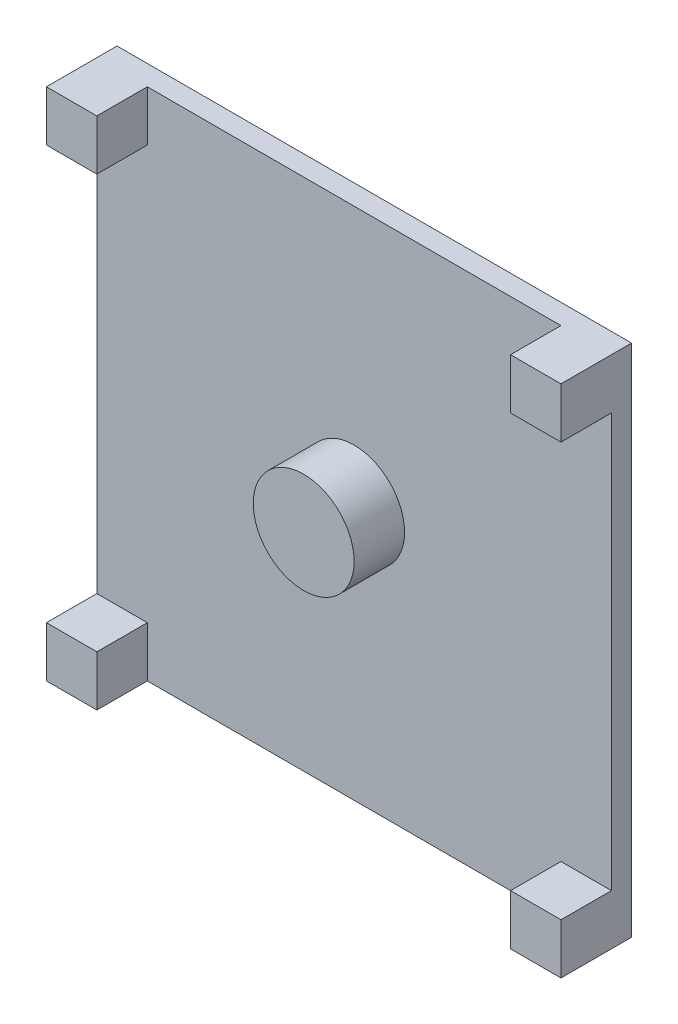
ISO-10303-21;
HEADER;
FILE_DESCRIPTION(('STEP AP214'),'2;1');
FILE_NAME('part.step','',(''),(''),'','','');
FILE_SCHEMA(('AUTOMOTIVE_DESIGN { 1 0 10303 214 1 1 1 1 }'));
ENDSEC;
DATA;
#1=APPLICATION_CONTEXT('core data for automotive mechanical design processes');
#2=APPLICATION_PROTOCOL_DEFINITION('international standard','automotive_design',2000,#1);
#3=PRODUCT_CONTEXT('',#1,'mechanical');
#4=PRODUCT('Part','Part','',(#3));
#5=PRODUCT_RELATED_PRODUCT_CATEGORY('part','',(#4));
#6=PRODUCT_DEFINITION_FORMATION('','',#4);
#7=PRODUCT_DEFINITION_CONTEXT('part definition',#1,'design');
#8=PRODUCT_DEFINITION('design','',#6,#7);
#9=PRODUCT_DEFINITION_SHAPE('','',#8);
#10=(LENGTH_UNIT() NAMED_UNIT(*) SI_UNIT(.MILLI.,.METRE.));
#11=(NAMED_UNIT(*) PLANE_ANGLE_UNIT() SI_UNIT($,.RADIAN.));
#12=(NAMED_UNIT(*) SI_UNIT($,.STERADIAN.) SOLID_ANGLE_UNIT());
#13=UNCERTAINTY_MEASURE_WITH_UNIT(LENGTH_MEASURE(1.E-05),#10,'distance_accuracy_value','');
#14=(GEOMETRIC_REPRESENTATION_CONTEXT(3) GLOBAL_UNCERTAINTY_ASSIGNED_CONTEXT((#13)) GLOBAL_UNIT_ASSIGNED_CONTEXT((#10,
#11,#12)) REPRESENTATION_CONTEXT('',''));
#15=CARTESIAN_POINT('',(0.,0.,0.));
#16=DIRECTION('',(0.,0.,1.));
#17=DIRECTION('',(1.,0.,0.));
#18=AXIS2_PLACEMENT_3D('',#15,#16,#17);
#19=CARTESIAN_POINT('',(-45.621214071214,-476.118135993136,20.));
#20=DIRECTION('',(0.,0.,1.));
#21=DIRECTION('',(1.,0.,0.));
#22=AXIS2_PLACEMENT_3D('',#19,#20,#21);
#23=PLANE('',#22);
#24=DIRECTION('',(0.,-1.,0.));
#25=VECTOR('',#24,1.);
#26=CARTESIAN_POINT('',(414.378785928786,-476.118135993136,20.));
#27=LINE('',#26,#25);
#28=CARTESIAN_POINT('',(414.378785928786,-426.118135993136,20.));
#29=VERTEX_POINT('',#28);
#30=CARTESIAN_POINT('',(414.378785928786,-476.118135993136,20.));
#31=VERTEX_POINT('',#30);
#32=EDGE_CURVE('E48',#29,#31,#27,.T.);
#33=ORIENTED_EDGE('',*,*,#32,.F.);
#34=DIRECTION('',(-1.,0.,0.));
#35=VECTOR('',#34,1.);
#36=CARTESIAN_POINT('',(464.378785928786,-426.118135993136,20.));
#37=LINE('',#36,#35);
#38=CARTESIAN_POINT('',(464.378785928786,-426.118135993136,20.));
#39=VERTEX_POINT('',#38);
#40=EDGE_CURVE('E338',#39,#29,#37,.T.);
#41=ORIENTED_EDGE('',*,*,#40,.F.);
#42=DIRECTION('',(0.,1.,0.));
#43=VECTOR('',#42,1.);
#44=CARTESIAN_POINT('',(464.378785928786,33.881864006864,20.));
#45=LINE('',#44,#43);
#46=CARTESIAN_POINT('',(464.378785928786,-16.118135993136,20.));
#47=VERTEX_POINT('',#46);
#48=EDGE_CURVE('E167',#39,#47,#45,.T.);
#49=ORIENTED_EDGE('',*,*,#48,.T.);
#50=DIRECTION('',(1.,0.,0.));
#51=VECTOR('',#50,1.);
#52=CARTESIAN_POINT('',(464.378785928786,-16.118135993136,20.));
#53=LINE('',#52,#51);
#54=CARTESIAN_POINT('',(414.378785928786,-16.118135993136,20.));
#55=VERTEX_POINT('',#54);
#56=EDGE_CURVE('E202',#55,#47,#53,.T.);
#57=ORIENTED_EDGE('',*,*,#56,.F.);
#58=DIRECTION('',(0.,-1.,0.));
#59=VECTOR('',#58,1.);
#60=CARTESIAN_POINT('',(414.378785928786,33.881864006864,20.));
#61=LINE('',#60,#59);
#62=CARTESIAN_POINT('',(414.378785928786,33.881864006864,20.));
#63=VERTEX_POINT('',#62);
#64=EDGE_CURVE('E197',#63,#55,#61,.T.);
#65=ORIENTED_EDGE('',*,*,#64,.F.);
#66=DIRECTION('',(-1.,0.,0.));
#67=VECTOR('',#66,1.);
#68=CARTESIAN_POINT('',(-45.6212140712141,33.881864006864,20.));
#69=LINE('',#68,#67);
#70=CARTESIAN_POINT('',(4.37878592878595,33.881864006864,20.));
#71=VERTEX_POINT('',#70);
#72=EDGE_CURVE('E34',#63,#71,#69,.T.);
#73=ORIENTED_EDGE('',*,*,#72,.T.);
#74=DIRECTION('',(0.,1.,0.));
#75=VECTOR('',#74,1.);
#76=CARTESIAN_POINT('',(4.37878592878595,33.881864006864,20.));
#77=LINE('',#76,#75);
#78=CARTESIAN_POINT('',(4.37878592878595,-16.118135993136,20.));
#79=VERTEX_POINT('',#78);
#80=EDGE_CURVE('E223',#79,#71,#77,.T.);
#81=ORIENTED_EDGE('',*,*,#80,.F.);
#82=DIRECTION('',(1.,0.,0.));
#83=VECTOR('',#82,1.);
#84=CARTESIAN_POINT('',(-45.6212140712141,-16.118135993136,20.));
#85=LINE('',#84,#83);
#86=CARTESIAN_POINT('',(-45.6212140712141,-16.118135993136,20.));
#87=VERTEX_POINT('',#86);
#88=EDGE_CURVE('E218',#87,#79,#85,.T.);
#89=ORIENTED_EDGE('',*,*,#88,.F.);
#90=DIRECTION('',(0.,-1.,0.));
#91=VECTOR('',#90,1.);
#92=CARTESIAN_POINT('',(-45.6212140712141,33.881864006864,20.));
#93=LINE('',#92,#91);
#94=CARTESIAN_POINT('',(-45.621214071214,-426.118135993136,20.));
#95=VERTEX_POINT('',#94);
#96=EDGE_CURVE('E264',#87,#95,#93,.T.);
#97=ORIENTED_EDGE('',*,*,#96,.T.);
#98=DIRECTION('',(-1.,0.,0.));
#99=VECTOR('',#98,1.);
#100=CARTESIAN_POINT('',(-45.621214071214,-426.118135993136,20.));
#101=LINE('',#100,#99);
#102=CARTESIAN_POINT('',(4.37878592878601,-426.118135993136,20.));
#103=VERTEX_POINT('',#102);
#104=EDGE_CURVE('E171',#103,#95,#101,.T.);
#105=ORIENTED_EDGE('',*,*,#104,.F.);
#106=DIRECTION('',(0.,1.,0.));
#107=VECTOR('',#106,1.);
#108=CARTESIAN_POINT('',(4.37878592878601,-476.118135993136,20.));
#109=LINE('',#108,#107);
#110=CARTESIAN_POINT('',(4.37878592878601,-476.118135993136,20.));
#111=VERTEX_POINT('',#110);
#112=EDGE_CURVE('E168',#111,#103,#109,.T.);
#113=ORIENTED_EDGE('',*,*,#112,.F.);
#114=DIRECTION('',(1.,0.,0.));
#115=VECTOR('',#114,1.);
#116=CARTESIAN_POINT('',(-45.621214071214,-476.118135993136,20.));
#117=LINE('',#116,#115);
#118=EDGE_CURVE('E53',#111,#31,#117,.T.);
#119=ORIENTED_EDGE('',*,*,#118,.T.);
#120=EDGE_LOOP('',(#33,#41,#49,#57,#65,#73,#81,#89,#97,#105,#113,#119));
#121=FACE_BOUND('',#120,.T.);
#122=CARTESIAN_POINT('',(209.378785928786,-221.118135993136,20.));
#123=DIRECTION('',(0.,0.,1.));
#124=DIRECTION('',(1.,0.,0.));
#125=AXIS2_PLACEMENT_3D('',#122,#123,#124);
#126=CIRCLE('',#125,50.0000000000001);
#127=CARTESIAN_POINT('',(259.378785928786,-221.118135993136,20.));
#128=VERTEX_POINT('',#127);
#129=EDGE_CURVE('E342',#128,#128,#126,.T.);
#130=ORIENTED_EDGE('',*,*,#129,.F.);
#131=EDGE_LOOP('',(#130));
#132=FACE_BOUND('',#131,.T.);
#133=ADVANCED_FACE('F30',(#121,#132),#23,.T.);
#134=CARTESIAN_POINT('',(-45.6212140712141,33.881864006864,20.));
#135=DIRECTION('',(1.,0.,0.));
#136=DIRECTION('',(0.,1.,0.));
#137=AXIS2_PLACEMENT_3D('',#134,#135,#136);
#138=PLANE('',#137);
#139=DIRECTION('',(0.,-1.,0.));
#140=VECTOR('',#139,1.);
#141=CARTESIAN_POINT('',(-45.6212140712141,33.881864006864,0.));
#142=LINE('',#141,#140);
#143=CARTESIAN_POINT('',(-45.6212140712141,33.881864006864,0.));
#144=VERTEX_POINT('',#143);
#145=CARTESIAN_POINT('',(-45.621214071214,-476.118135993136,0.));
#146=VERTEX_POINT('',#145);
#147=EDGE_CURVE('E253',#144,#146,#142,.T.);
#148=ORIENTED_EDGE('',*,*,#147,.T.);
#149=DIRECTION('',(0.,0.,-1.));
#150=VECTOR('',#149,1.);
#151=CARTESIAN_POINT('',(-45.621214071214,-476.118135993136,20.));
#152=LINE('',#151,#150);
#153=CARTESIAN_POINT('',(-45.621214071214,-476.118135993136,70.));
#154=VERTEX_POINT('',#153);
#155=EDGE_CURVE('E11',#154,#146,#152,.T.);
#156=ORIENTED_EDGE('',*,*,#155,.F.);
#157=DIRECTION('',(0.,-1.,0.));
#158=VECTOR('',#157,1.);
#159=CARTESIAN_POINT('',(-45.621214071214,-476.118135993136,70.));
#160=LINE('',#159,#158);
#161=CARTESIAN_POINT('',(-45.621214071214,-426.118135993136,70.));
#162=VERTEX_POINT('',#161);
#163=EDGE_CURVE('E177',#162,#154,#160,.T.);
#164=ORIENTED_EDGE('',*,*,#163,.F.);
#165=DIRECTION('',(0.,0.,-1.));
#166=VECTOR('',#165,1.);
#167=CARTESIAN_POINT('',(-45.621214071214,-426.118135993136,70.));
#168=LINE('',#167,#166);
#169=EDGE_CURVE('E185',#162,#95,#168,.T.);
#170=ORIENTED_EDGE('',*,*,#169,.T.);
#171=ORIENTED_EDGE('',*,*,#96,.F.);
#172=DIRECTION('',(0.,0.,-1.));
#173=VECTOR('',#172,1.);
#174=CARTESIAN_POINT('',(-45.6212140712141,-16.118135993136,70.));
#175=LINE('',#174,#173);
#176=CARTESIAN_POINT('',(-45.6212140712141,-16.118135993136,70.));
#177=VERTEX_POINT('',#176);
#178=EDGE_CURVE('E248',#177,#87,#175,.T.);
#179=ORIENTED_EDGE('',*,*,#178,.F.);
#180=DIRECTION('',(0.,-1.,0.));
#181=VECTOR('',#180,1.);
#182=CARTESIAN_POINT('',(-45.6212140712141,33.881864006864,70.));
#183=LINE('',#182,#181);
#184=CARTESIAN_POINT('',(-45.6212140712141,33.881864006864,70.));
#185=VERTEX_POINT('',#184);
#186=EDGE_CURVE('E219',#185,#177,#183,.T.);
#187=ORIENTED_EDGE('',*,*,#186,.F.);
#188=DIRECTION('',(0.,0.,-1.));
#189=VECTOR('',#188,1.);
#190=CARTESIAN_POINT('',(-45.6212140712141,33.881864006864,20.));
#191=LINE('',#190,#189);
#192=EDGE_CURVE('E276',#185,#144,#191,.T.);
#193=ORIENTED_EDGE('',*,*,#192,.T.);
#194=EDGE_LOOP('',(#148,#156,#164,#170,#171,#179,#187,#193));
#195=FACE_BOUND('',#194,.T.);
#196=ADVANCED_FACE('F32',(#195),#138,.F.);
#197=CARTESIAN_POINT('',(-45.621214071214,-476.118135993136,20.));
#198=DIRECTION('',(0.,1.,0.));
#199=DIRECTION('',(0.,0.,1.));
#200=AXIS2_PLACEMENT_3D('',#197,#198,#199);
#201=PLANE('',#200);
#202=DIRECTION('',(1.,0.,0.));
#203=VECTOR('',#202,1.);
#204=CARTESIAN_POINT('',(-45.621214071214,-476.118135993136,0.));
#205=LINE('',#204,#203);
#206=CARTESIAN_POINT('',(464.378785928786,-476.118135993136,0.));
#207=VERTEX_POINT('',#206);
#208=EDGE_CURVE('E258',#146,#207,#205,.T.);
#209=ORIENTED_EDGE('',*,*,#208,.T.);
#210=DIRECTION('',(0.,0.,-1.));
#211=VECTOR('',#210,1.);
#212=CARTESIAN_POINT('',(464.378785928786,-476.118135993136,20.));
#213=LINE('',#212,#211);
#214=CARTESIAN_POINT('',(464.378785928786,-476.118135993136,70.));
#215=VERTEX_POINT('',#214);
#216=EDGE_CURVE('E40',#215,#207,#213,.T.);
#217=ORIENTED_EDGE('',*,*,#216,.F.);
#218=DIRECTION('',(1.,0.,0.));
#219=VECTOR('',#218,1.);
#220=CARTESIAN_POINT('',(464.378785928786,-476.118135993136,70.));
#221=LINE('',#220,#219);
#222=CARTESIAN_POINT('',(414.378785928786,-476.118135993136,70.));
#223=VERTEX_POINT('',#222);
#224=EDGE_CURVE('E161',#223,#215,#221,.T.);
#225=ORIENTED_EDGE('',*,*,#224,.F.);
#226=DIRECTION('',(0.,0.,-1.));
#227=VECTOR('',#226,1.);
#228=CARTESIAN_POINT('',(414.378785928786,-476.118135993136,70.));
#229=LINE('',#228,#227);
#230=EDGE_CURVE('E173',#223,#31,#229,.T.);
#231=ORIENTED_EDGE('',*,*,#230,.T.);
#232=ORIENTED_EDGE('',*,*,#118,.F.);
#233=DIRECTION('',(0.,0.,-1.));
#234=VECTOR('',#233,1.);
#235=CARTESIAN_POINT('',(4.37878592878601,-476.118135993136,70.));
#236=LINE('',#235,#234);
#237=CARTESIAN_POINT('',(4.37878592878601,-476.118135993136,70.));
#238=VERTEX_POINT('',#237);
#239=EDGE_CURVE('E194',#238,#111,#236,.T.);
#240=ORIENTED_EDGE('',*,*,#239,.F.);
#241=DIRECTION('',(1.,0.,0.));
#242=VECTOR('',#241,1.);
#243=CARTESIAN_POINT('',(-45.621214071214,-476.118135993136,70.));
#244=LINE('',#243,#242);
#245=EDGE_CURVE('E180',#154,#238,#244,.T.);
#246=ORIENTED_EDGE('',*,*,#245,.F.);
#247=ORIENTED_EDGE('',*,*,#155,.T.);
#248=EDGE_LOOP('',(#209,#217,#225,#231,#232,#240,#246,#247));
#249=FACE_BOUND('',#248,.T.);
#250=ADVANCED_FACE('F311',(#249),#201,.F.);
#251=CARTESIAN_POINT('',(464.378785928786,33.881864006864,20.));
#252=DIRECTION('',(-1.,0.,0.));
#253=DIRECTION('',(0.,-1.,0.));
#254=AXIS2_PLACEMENT_3D('',#251,#252,#253);
#255=PLANE('',#254);
#256=DIRECTION('',(0.,1.,0.));
#257=VECTOR('',#256,1.);
#258=CARTESIAN_POINT('',(464.378785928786,33.881864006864,0.));
#259=LINE('',#258,#257);
#260=CARTESIAN_POINT('',(464.378785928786,33.881864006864,0.));
#261=VERTEX_POINT('',#260);
#262=EDGE_CURVE('E273',#207,#261,#259,.T.);
#263=ORIENTED_EDGE('',*,*,#262,.T.);
#264=DIRECTION('',(0.,0.,-1.));
#265=VECTOR('',#264,1.);
#266=CARTESIAN_POINT('',(464.378785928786,33.881864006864,20.));
#267=LINE('',#266,#265);
#268=CARTESIAN_POINT('',(464.378785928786,33.881864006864,70.));
#269=VERTEX_POINT('',#268);
#270=EDGE_CURVE('E279',#269,#261,#267,.T.);
#271=ORIENTED_EDGE('',*,*,#270,.F.);
#272=DIRECTION('',(0.,1.,0.));
#273=VECTOR('',#272,1.);
#274=CARTESIAN_POINT('',(464.378785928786,33.881864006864,70.));
#275=LINE('',#274,#273);
#276=CARTESIAN_POINT('',(464.378785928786,-16.118135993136,70.));
#277=VERTEX_POINT('',#276);
#278=EDGE_CURVE('E198',#277,#269,#275,.T.);
#279=ORIENTED_EDGE('',*,*,#278,.F.);
#280=DIRECTION('',(0.,0.,-1.));
#281=VECTOR('',#280,1.);
#282=CARTESIAN_POINT('',(464.378785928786,-16.118135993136,70.));
#283=LINE('',#282,#281);
#284=EDGE_CURVE('E208',#277,#47,#283,.T.);
#285=ORIENTED_EDGE('',*,*,#284,.T.);
#286=ORIENTED_EDGE('',*,*,#48,.F.);
#287=DIRECTION('',(0.,0.,-1.));
#288=VECTOR('',#287,1.);
#289=CARTESIAN_POINT('',(464.378785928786,-426.118135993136,70.));
#290=LINE('',#289,#288);
#291=CARTESIAN_POINT('',(464.378785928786,-426.118135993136,70.));
#292=VERTEX_POINT('',#291);
#293=EDGE_CURVE('E149',#292,#39,#290,.T.);
#294=ORIENTED_EDGE('',*,*,#293,.F.);
#295=DIRECTION('',(0.,1.,0.));
#296=VECTOR('',#295,1.);
#297=CARTESIAN_POINT('',(464.378785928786,-476.118135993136,70.));
#298=LINE('',#297,#296);
#299=EDGE_CURVE('E155',#215,#292,#298,.T.);
#300=ORIENTED_EDGE('',*,*,#299,.F.);
#301=ORIENTED_EDGE('',*,*,#216,.T.);
#302=EDGE_LOOP('',(#263,#271,#279,#285,#286,#294,#300,#301));
#303=FACE_BOUND('',#302,.T.);
#304=ADVANCED_FACE('F165',(#303),#255,.F.);
#305=CARTESIAN_POINT('',(-45.6212140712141,33.881864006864,20.));
#306=DIRECTION('',(0.,-1.,0.));
#307=DIRECTION('',(0.,0.,-1.));
#308=AXIS2_PLACEMENT_3D('',#305,#306,#307);
#309=PLANE('',#308);
#310=DIRECTION('',(-1.,0.,0.));
#311=VECTOR('',#310,1.);
#312=CARTESIAN_POINT('',(-45.6212140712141,33.881864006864,0.));
#313=LINE('',#312,#311);
#314=EDGE_CURVE('E265',#261,#144,#313,.T.);
#315=ORIENTED_EDGE('',*,*,#314,.T.);
#316=ORIENTED_EDGE('',*,*,#192,.F.);
#317=DIRECTION('',(-1.,0.,0.));
#318=VECTOR('',#317,1.);
#319=CARTESIAN_POINT('',(-45.6212140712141,33.881864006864,70.));
#320=LINE('',#319,#318);
#321=CARTESIAN_POINT('',(4.37878592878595,33.881864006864,70.));
#322=VERTEX_POINT('',#321);
#323=EDGE_CURVE('E227',#322,#185,#320,.T.);
#324=ORIENTED_EDGE('',*,*,#323,.F.);
#325=DIRECTION('',(0.,0.,-1.));
#326=VECTOR('',#325,1.);
#327=CARTESIAN_POINT('',(4.37878592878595,33.881864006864,70.));
#328=LINE('',#327,#326);
#329=EDGE_CURVE('E230',#322,#71,#328,.T.);
#330=ORIENTED_EDGE('',*,*,#329,.T.);
#331=ORIENTED_EDGE('',*,*,#72,.F.);
#332=DIRECTION('',(0.,0.,-1.));
#333=VECTOR('',#332,1.);
#334=CARTESIAN_POINT('',(414.378785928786,33.881864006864,70.));
#335=LINE('',#334,#333);
#336=CARTESIAN_POINT('',(414.378785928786,33.881864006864,70.));
#337=VERTEX_POINT('',#336);
#338=EDGE_CURVE('E216',#337,#63,#335,.T.);
#339=ORIENTED_EDGE('',*,*,#338,.F.);
#340=DIRECTION('',(-1.,0.,0.));
#341=VECTOR('',#340,1.);
#342=CARTESIAN_POINT('',(464.378785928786,33.881864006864,70.));
#343=LINE('',#342,#341);
#344=EDGE_CURVE('E201',#269,#337,#343,.T.);
#345=ORIENTED_EDGE('',*,*,#344,.F.);
#346=ORIENTED_EDGE('',*,*,#270,.T.);
#347=EDGE_LOOP('',(#315,#316,#324,#330,#331,#339,#345,#346));
#348=FACE_BOUND('',#347,.T.);
#349=ADVANCED_FACE('F287',(#348),#309,.F.);
#350=CARTESIAN_POINT('',(-45.621214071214,-476.118135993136,0.));
#351=DIRECTION('',(0.,0.,1.));
#352=DIRECTION('',(1.,0.,0.));
#353=AXIS2_PLACEMENT_3D('',#350,#351,#352);
#354=PLANE('',#353);
#355=ORIENTED_EDGE('',*,*,#147,.F.);
#356=ORIENTED_EDGE('',*,*,#314,.F.);
#357=ORIENTED_EDGE('',*,*,#262,.F.);
#358=ORIENTED_EDGE('',*,*,#208,.F.);
#359=EDGE_LOOP('',(#355,#356,#357,#358));
#360=FACE_BOUND('',#359,.T.);
#361=ADVANCED_FACE('F286',(#360),#354,.F.);
#362=CARTESIAN_POINT('',(-45.6212140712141,-16.118135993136,70.));
#363=DIRECTION('',(0.,1.,0.));
#364=DIRECTION('',(0.,0.,1.));
#365=AXIS2_PLACEMENT_3D('',#362,#363,#364);
#366=PLANE('',#365);
#367=ORIENTED_EDGE('',*,*,#88,.T.);
#368=DIRECTION('',(0.,0.,-1.));
#369=VECTOR('',#368,1.);
#370=CARTESIAN_POINT('',(4.37878592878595,-16.118135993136,70.));
#371=LINE('',#370,#369);
#372=CARTESIAN_POINT('',(4.37878592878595,-16.118135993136,70.));
#373=VERTEX_POINT('',#372);
#374=EDGE_CURVE('E233',#373,#79,#371,.T.);
#375=ORIENTED_EDGE('',*,*,#374,.F.);
#376=DIRECTION('',(1.,0.,0.));
#377=VECTOR('',#376,1.);
#378=CARTESIAN_POINT('',(-45.6212140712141,-16.118135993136,70.));
#379=LINE('',#378,#377);
#380=EDGE_CURVE('E222',#177,#373,#379,.T.);
#381=ORIENTED_EDGE('',*,*,#380,.F.);
#382=ORIENTED_EDGE('',*,*,#178,.T.);
#383=EDGE_LOOP('',(#367,#375,#381,#382));
#384=FACE_BOUND('',#383,.T.);
#385=ADVANCED_FACE('F297',(#384),#366,.F.);
#386=CARTESIAN_POINT('',(4.37878592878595,33.881864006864,70.));
#387=DIRECTION('',(-1.,0.,0.));
#388=DIRECTION('',(0.,-1.,0.));
#389=AXIS2_PLACEMENT_3D('',#386,#387,#388);
#390=PLANE('',#389);
#391=ORIENTED_EDGE('',*,*,#80,.T.);
#392=ORIENTED_EDGE('',*,*,#329,.F.);
#393=DIRECTION('',(0.,1.,0.));
#394=VECTOR('',#393,1.);
#395=CARTESIAN_POINT('',(4.37878592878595,33.881864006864,70.));
#396=LINE('',#395,#394);
#397=EDGE_CURVE('E225',#373,#322,#396,.T.);
#398=ORIENTED_EDGE('',*,*,#397,.F.);
#399=ORIENTED_EDGE('',*,*,#374,.T.);
#400=EDGE_LOOP('',(#391,#392,#398,#399));
#401=FACE_BOUND('',#400,.T.);
#402=ADVANCED_FACE('F294',(#401),#390,.F.);
#403=CARTESIAN_POINT('',(-45.6212140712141,-16.118135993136,70.));
#404=DIRECTION('',(0.,0.,1.));
#405=DIRECTION('',(1.,0.,0.));
#406=AXIS2_PLACEMENT_3D('',#403,#404,#405);
#407=PLANE('',#406);
#408=ORIENTED_EDGE('',*,*,#186,.T.);
#409=ORIENTED_EDGE('',*,*,#380,.T.);
#410=ORIENTED_EDGE('',*,*,#397,.T.);
#411=ORIENTED_EDGE('',*,*,#323,.T.);
#412=EDGE_LOOP('',(#408,#409,#410,#411));
#413=FACE_BOUND('',#412,.T.);
#414=ADVANCED_FACE('F293',(#413),#407,.T.);
#415=CARTESIAN_POINT('',(414.378785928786,33.881864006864,70.));
#416=DIRECTION('',(1.,0.,0.));
#417=DIRECTION('',(0.,0.,-1.));
#418=AXIS2_PLACEMENT_3D('',#415,#416,#417);
#419=PLANE('',#418);
#420=ORIENTED_EDGE('',*,*,#64,.T.);
#421=DIRECTION('',(0.,0.,-1.));
#422=VECTOR('',#421,1.);
#423=CARTESIAN_POINT('',(414.378785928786,-16.118135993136,70.));
#424=LINE('',#423,#422);
#425=CARTESIAN_POINT('',(414.378785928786,-16.118135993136,70.));
#426=VERTEX_POINT('',#425);
#427=EDGE_CURVE('E214',#426,#55,#424,.T.);
#428=ORIENTED_EDGE('',*,*,#427,.F.);
#429=DIRECTION('',(0.,-1.,0.));
#430=VECTOR('',#429,1.);
#431=CARTESIAN_POINT('',(414.378785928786,33.881864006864,70.));
#432=LINE('',#431,#430);
#433=EDGE_CURVE('E204',#337,#426,#432,.T.);
#434=ORIENTED_EDGE('',*,*,#433,.F.);
#435=ORIENTED_EDGE('',*,*,#338,.T.);
#436=EDGE_LOOP('',(#420,#428,#434,#435));
#437=FACE_BOUND('',#436,.T.);
#438=ADVANCED_FACE('F380',(#437),#419,.F.);
#439=CARTESIAN_POINT('',(464.378785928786,-16.118135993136,70.));
#440=DIRECTION('',(0.,1.,0.));
#441=DIRECTION('',(-1.,0.,0.));
#442=AXIS2_PLACEMENT_3D('',#439,#440,#441);
#443=PLANE('',#442);
#444=ORIENTED_EDGE('',*,*,#56,.T.);
#445=ORIENTED_EDGE('',*,*,#284,.F.);
#446=DIRECTION('',(1.,0.,0.));
#447=VECTOR('',#446,1.);
#448=CARTESIAN_POINT('',(464.378785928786,-16.118135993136,70.));
#449=LINE('',#448,#447);
#450=EDGE_CURVE('E206',#426,#277,#449,.T.);
#451=ORIENTED_EDGE('',*,*,#450,.F.);
#452=ORIENTED_EDGE('',*,*,#427,.T.);
#453=EDGE_LOOP('',(#444,#445,#451,#452));
#454=FACE_BOUND('',#453,.T.);
#455=ADVANCED_FACE('F376',(#454),#443,.F.);
#456=CARTESIAN_POINT('',(464.378785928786,-16.118135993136,70.));
#457=DIRECTION('',(0.,0.,-1.));
#458=DIRECTION('',(-1.,0.,0.));
#459=AXIS2_PLACEMENT_3D('',#456,#457,#458);
#460=PLANE('',#459);
#461=ORIENTED_EDGE('',*,*,#278,.T.);
#462=ORIENTED_EDGE('',*,*,#344,.T.);
#463=ORIENTED_EDGE('',*,*,#433,.T.);
#464=ORIENTED_EDGE('',*,*,#450,.T.);
#465=EDGE_LOOP('',(#461,#462,#463,#464));
#466=FACE_BOUND('',#465,.T.);
#467=ADVANCED_FACE('F373',(#466),#460,.F.);
#468=CARTESIAN_POINT('',(4.37878592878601,-476.118135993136,70.));
#469=DIRECTION('',(-1.,0.,0.));
#470=DIRECTION('',(0.,0.,1.));
#471=AXIS2_PLACEMENT_3D('',#468,#469,#470);
#472=PLANE('',#471);
#473=ORIENTED_EDGE('',*,*,#112,.T.);
#474=DIRECTION('',(0.,0.,-1.));
#475=VECTOR('',#474,1.);
#476=CARTESIAN_POINT('',(4.37878592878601,-426.118135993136,70.));
#477=LINE('',#476,#475);
#478=CARTESIAN_POINT('',(4.37878592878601,-426.118135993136,70.));
#479=VERTEX_POINT('',#478);
#480=EDGE_CURVE('E191',#479,#103,#477,.T.);
#481=ORIENTED_EDGE('',*,*,#480,.F.);
#482=DIRECTION('',(0.,1.,0.));
#483=VECTOR('',#482,1.);
#484=CARTESIAN_POINT('',(4.37878592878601,-476.118135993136,70.));
#485=LINE('',#484,#483);
#486=EDGE_CURVE('E182',#238,#479,#485,.T.);
#487=ORIENTED_EDGE('',*,*,#486,.F.);
#488=ORIENTED_EDGE('',*,*,#239,.T.);
#489=EDGE_LOOP('',(#473,#481,#487,#488));
#490=FACE_BOUND('',#489,.T.);
#491=ADVANCED_FACE('F331',(#490),#472,.F.);
#492=CARTESIAN_POINT('',(-45.621214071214,-426.118135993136,70.));
#493=DIRECTION('',(0.,-1.,0.));
#494=DIRECTION('',(0.,0.,-1.));
#495=AXIS2_PLACEMENT_3D('',#492,#493,#494);
#496=PLANE('',#495);
#497=ORIENTED_EDGE('',*,*,#104,.T.);
#498=ORIENTED_EDGE('',*,*,#169,.F.);
#499=DIRECTION('',(-1.,0.,0.));
#500=VECTOR('',#499,1.);
#501=CARTESIAN_POINT('',(-45.621214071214,-426.118135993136,70.));
#502=LINE('',#501,#500);
#503=EDGE_CURVE('E184',#479,#162,#502,.T.);
#504=ORIENTED_EDGE('',*,*,#503,.F.);
#505=ORIENTED_EDGE('',*,*,#480,.T.);
#506=EDGE_LOOP('',(#497,#498,#504,#505));
#507=FACE_BOUND('',#506,.T.);
#508=ADVANCED_FACE('F329',(#507),#496,.F.);
#509=CARTESIAN_POINT('',(-45.621214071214,-426.118135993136,70.));
#510=DIRECTION('',(0.,0.,-1.));
#511=DIRECTION('',(-1.,0.,0.));
#512=AXIS2_PLACEMENT_3D('',#509,#510,#511);
#513=PLANE('',#512);
#514=ORIENTED_EDGE('',*,*,#163,.T.);
#515=ORIENTED_EDGE('',*,*,#245,.T.);
#516=ORIENTED_EDGE('',*,*,#486,.T.);
#517=ORIENTED_EDGE('',*,*,#503,.T.);
#518=EDGE_LOOP('',(#514,#515,#516,#517));
#519=FACE_BOUND('',#518,.T.);
#520=ADVANCED_FACE('F324',(#519),#513,.F.);
#521=CARTESIAN_POINT('',(464.378785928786,-426.118135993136,70.));
#522=DIRECTION('',(0.,-1.,0.));
#523=DIRECTION('',(0.,0.,-1.));
#524=AXIS2_PLACEMENT_3D('',#521,#522,#523);
#525=PLANE('',#524);
#526=ORIENTED_EDGE('',*,*,#40,.T.);
#527=DIRECTION('',(0.,0.,-1.));
#528=VECTOR('',#527,1.);
#529=CARTESIAN_POINT('',(414.378785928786,-426.118135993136,70.));
#530=LINE('',#529,#528);
#531=CARTESIAN_POINT('',(414.378785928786,-426.118135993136,70.));
#532=VERTEX_POINT('',#531);
#533=EDGE_CURVE('E151',#532,#29,#530,.T.);
#534=ORIENTED_EDGE('',*,*,#533,.F.);
#535=DIRECTION('',(-1.,0.,0.));
#536=VECTOR('',#535,1.);
#537=CARTESIAN_POINT('',(464.378785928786,-426.118135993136,70.));
#538=LINE('',#537,#536);
#539=EDGE_CURVE('E145',#292,#532,#538,.T.);
#540=ORIENTED_EDGE('',*,*,#539,.F.);
#541=ORIENTED_EDGE('',*,*,#293,.T.);
#542=EDGE_LOOP('',(#526,#534,#540,#541));
#543=FACE_BOUND('',#542,.T.);
#544=ADVANCED_FACE('F147',(#543),#525,.F.);
#545=CARTESIAN_POINT('',(414.378785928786,-476.118135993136,70.));
#546=DIRECTION('',(1.,0.,0.));
#547=DIRECTION('',(0.,0.,-1.));
#548=AXIS2_PLACEMENT_3D('',#545,#546,#547);
#549=PLANE('',#548);
#550=ORIENTED_EDGE('',*,*,#32,.T.);
#551=ORIENTED_EDGE('',*,*,#230,.F.);
#552=DIRECTION('',(0.,-1.,0.));
#553=VECTOR('',#552,1.);
#554=CARTESIAN_POINT('',(414.378785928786,-476.118135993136,70.));
#555=LINE('',#554,#553);
#556=EDGE_CURVE('E154',#532,#223,#555,.T.);
#557=ORIENTED_EDGE('',*,*,#556,.F.);
#558=ORIENTED_EDGE('',*,*,#533,.T.);
#559=EDGE_LOOP('',(#550,#551,#557,#558));
#560=FACE_BOUND('',#559,.T.);
#561=ADVANCED_FACE('F360',(#560),#549,.F.);
#562=CARTESIAN_POINT('',(464.378785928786,-426.118135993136,70.));
#563=DIRECTION('',(0.,0.,1.));
#564=DIRECTION('',(1.,0.,0.));
#565=AXIS2_PLACEMENT_3D('',#562,#563,#564);
#566=PLANE('',#565);
#567=ORIENTED_EDGE('',*,*,#299,.T.);
#568=ORIENTED_EDGE('',*,*,#539,.T.);
#569=ORIENTED_EDGE('',*,*,#556,.T.);
#570=ORIENTED_EDGE('',*,*,#224,.T.);
#571=EDGE_LOOP('',(#567,#568,#569,#570));
#572=FACE_BOUND('',#571,.T.);
#573=ADVANCED_FACE('F159',(#572),#566,.T.);
#574=CARTESIAN_POINT('',(209.378785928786,-221.118135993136,70.));
#575=DIRECTION('',(0.,0.,-1.));
#576=DIRECTION('',(-1.,0.,0.));
#577=AXIS2_PLACEMENT_3D('',#574,#575,#576);
#578=CYLINDRICAL_SURFACE('',#577,50.0000000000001);
#579=CARTESIAN_POINT('',(209.378785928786,-221.118135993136,70.));
#580=DIRECTION('',(0.,0.,1.));
#581=DIRECTION('',(1.,0.,0.));
#582=AXIS2_PLACEMENT_3D('',#579,#580,#581);
#583=CIRCLE('',#582,50.0000000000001);
#584=CARTESIAN_POINT('',(259.378785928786,-221.118135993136,70.));
#585=VERTEX_POINT('',#584);
#586=EDGE_CURVE('E339',#585,#585,#583,.T.);
#587=ORIENTED_EDGE('',*,*,#586,.F.);
#588=EDGE_LOOP('',(#587));
#589=FACE_BOUND('',#588,.T.);
#590=ORIENTED_EDGE('',*,*,#129,.T.);
#591=EDGE_LOOP('',(#590));
#592=FACE_BOUND('',#591,.T.);
#593=ADVANCED_FACE('F350',(#589,#592),#578,.T.);
#594=CARTESIAN_POINT('',(209.378785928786,-221.118135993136,70.));
#595=DIRECTION('',(0.,0.,1.));
#596=DIRECTION('',(1.,0.,0.));
#597=AXIS2_PLACEMENT_3D('',#594,#595,#596);
#598=PLANE('',#597);
#599=ORIENTED_EDGE('',*,*,#586,.T.);
#600=EDGE_LOOP('',(#599));
#601=FACE_BOUND('',#600,.T.);
#602=ADVANCED_FACE('F348',(#601),#598,.T.);
#603=CLOSED_SHELL('',(#133,#196,#250,#304,#349,#361,#385,#402,#414,#438,#455,#467,#491,#508,
#520,#544,#561,#573,#593,#602));
#604=MANIFOLD_SOLID_BREP('B2',#603);
#605=ADVANCED_BREP_SHAPE_REPRESENTATION('',(#18,#604),#14);
#606=SHAPE_DEFINITION_REPRESENTATION(#9,#605);
ENDSEC;
END-ISO-10303-21;
